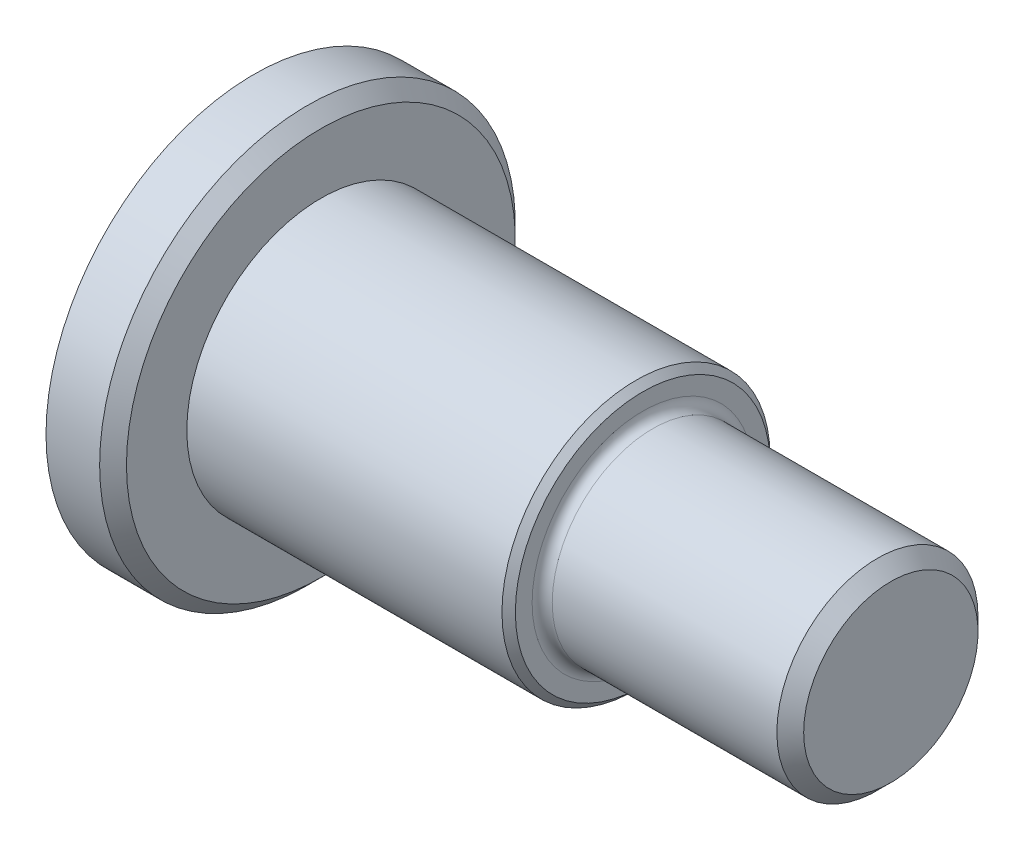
ISO-10303-21;
HEADER;
FILE_DESCRIPTION(('STEP AP214'),'2;1');
FILE_NAME('part.step','',(''),(''),'','','');
FILE_SCHEMA(('AUTOMOTIVE_DESIGN { 1 0 10303 214 1 1 1 1 }'));
ENDSEC;
DATA;
#1=APPLICATION_CONTEXT('core data for automotive mechanical design processes');
#2=APPLICATION_PROTOCOL_DEFINITION('international standard','automotive_design',2000,#1);
#3=PRODUCT_CONTEXT('',#1,'mechanical');
#4=PRODUCT('Part','Part','',(#3));
#5=PRODUCT_RELATED_PRODUCT_CATEGORY('part','',(#4));
#6=PRODUCT_DEFINITION_FORMATION('','',#4);
#7=PRODUCT_DEFINITION_CONTEXT('part definition',#1,'design');
#8=PRODUCT_DEFINITION('design','',#6,#7);
#9=PRODUCT_DEFINITION_SHAPE('','',#8);
#10=(LENGTH_UNIT() NAMED_UNIT(*) SI_UNIT(.MILLI.,.METRE.));
#11=(NAMED_UNIT(*) PLANE_ANGLE_UNIT() SI_UNIT($,.RADIAN.));
#12=(NAMED_UNIT(*) SI_UNIT($,.STERADIAN.) SOLID_ANGLE_UNIT());
#13=UNCERTAINTY_MEASURE_WITH_UNIT(LENGTH_MEASURE(1.E-05),#10,'distance_accuracy_value','');
#14=(GEOMETRIC_REPRESENTATION_CONTEXT(3) GLOBAL_UNCERTAINTY_ASSIGNED_CONTEXT((#13)) GLOBAL_UNIT_ASSIGNED_CONTEXT((#10,
#11,#12)) REPRESENTATION_CONTEXT('',''));
#15=CARTESIAN_POINT('',(0.,0.,0.));
#16=DIRECTION('',(0.,0.,1.));
#17=DIRECTION('',(1.,0.,0.));
#18=AXIS2_PLACEMENT_3D('',#15,#16,#17);
#19=CARTESIAN_POINT('',(1.50000000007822,0.,0.));
#20=DIRECTION('',(-1.,0.,0.));
#21=DIRECTION('',(0.,0.,1.));
#22=AXIS2_PLACEMENT_3D('',#19,#20,#21);
#23=CONICAL_SURFACE('',#22,1.2499999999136,1.02974425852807);
#24=CARTESIAN_POINT('',(2.25107577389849,0.,-5.6843418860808E-11));
#25=VERTEX_POINT('',#24);
#26=VERTEX_LOOP('',#25);
#27=FACE_BOUND('',#26,.T.);
#28=CARTESIAN_POINT('',(1.49999999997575,0.,0.));
#29=DIRECTION('',(-1.,0.,0.));
#30=DIRECTION('',(0.,0.,1.));
#31=AXIS2_PLACEMENT_3D('',#28,#29,#30);
#32=CIRCLE('',#31,1.25000000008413);
#33=CARTESIAN_POINT('',(1.49999999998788,-0.625000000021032,1.08253175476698));
#34=VERTEX_POINT('',#33);
#35=CARTESIAN_POINT('',(1.49999999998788,-1.25000000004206,0.));
#36=VERTEX_POINT('',#35);
#37=EDGE_CURVE('E157',#34,#36,#32,.F.);
#38=ORIENTED_EDGE('',*,*,#37,.F.);
#39=CARTESIAN_POINT('',(1.49999999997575,0.,0.));
#40=DIRECTION('',(-1.,0.,0.));
#41=DIRECTION('',(0.,0.,1.));
#42=AXIS2_PLACEMENT_3D('',#39,#40,#41);
#43=CIRCLE('',#42,1.25000000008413);
#44=CARTESIAN_POINT('',(1.49999999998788,0.625000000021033,1.08253175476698));
#45=VERTEX_POINT('',#44);
#46=EDGE_CURVE('E154',#45,#34,#43,.F.);
#47=ORIENTED_EDGE('',*,*,#46,.F.);
#48=CARTESIAN_POINT('',(1.49999999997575,0.,0.));
#49=DIRECTION('',(-1.,0.,0.));
#50=DIRECTION('',(0.,0.,1.));
#51=AXIS2_PLACEMENT_3D('',#48,#49,#50);
#52=CIRCLE('',#51,1.25000000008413);
#53=CARTESIAN_POINT('',(1.49999999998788,1.25000000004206,0.));
#54=VERTEX_POINT('',#53);
#55=EDGE_CURVE('E110',#54,#45,#52,.F.);
#56=ORIENTED_EDGE('',*,*,#55,.F.);
#57=CARTESIAN_POINT('',(1.49999999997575,0.,0.));
#58=DIRECTION('',(-1.,0.,0.));
#59=DIRECTION('',(0.,0.,1.));
#60=AXIS2_PLACEMENT_3D('',#57,#58,#59);
#61=CIRCLE('',#60,1.25000000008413);
#62=CARTESIAN_POINT('',(1.49999999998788,0.625000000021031,-1.08253175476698));
#63=VERTEX_POINT('',#62);
#64=EDGE_CURVE('E106',#63,#54,#61,.F.);
#65=ORIENTED_EDGE('',*,*,#64,.F.);
#66=CARTESIAN_POINT('',(1.49999999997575,0.,0.));
#67=DIRECTION('',(-1.,0.,0.));
#68=DIRECTION('',(0.,0.,1.));
#69=AXIS2_PLACEMENT_3D('',#66,#67,#68);
#70=CIRCLE('',#69,1.25000000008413);
#71=CARTESIAN_POINT('',(1.49999999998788,-0.625000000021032,-1.08253175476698));
#72=VERTEX_POINT('',#71);
#73=EDGE_CURVE('E93',#72,#63,#70,.F.);
#74=ORIENTED_EDGE('',*,*,#73,.F.);
#75=CARTESIAN_POINT('',(1.49999999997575,0.,0.));
#76=DIRECTION('',(-1.,0.,0.));
#77=DIRECTION('',(0.,0.,1.));
#78=AXIS2_PLACEMENT_3D('',#75,#76,#77);
#79=CIRCLE('',#78,1.25000000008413);
#80=EDGE_CURVE('E103',#36,#72,#79,.F.);
#81=ORIENTED_EDGE('',*,*,#80,.F.);
#82=EDGE_LOOP('',(#38,#47,#56,#65,#74,#81));
#83=FACE_BOUND('',#82,.T.);
#84=ADVANCED_FACE('F17',(#27,#83),#23,.F.);
#85=CARTESIAN_POINT('',(9.5,1.5,0.));
#86=DIRECTION('',(-1.,0.,0.));
#87=DIRECTION('',(0.,0.,1.));
#88=AXIS2_PLACEMENT_3D('',#85,#86,#87);
#89=PLANE('',#88);
#90=CARTESIAN_POINT('',(9.50000000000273,0.,0.));
#91=DIRECTION('',(-1.,0.,0.));
#92=DIRECTION('',(0.,0.,1.));
#93=AXIS2_PLACEMENT_3D('',#90,#91,#92);
#94=CIRCLE('',#93,1.30000000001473);
#95=CARTESIAN_POINT('',(9.50000000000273,0.,1.30000000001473));
#96=VERTEX_POINT('',#95);
#97=EDGE_CURVE('E114',#96,#96,#94,.T.);
#98=ORIENTED_EDGE('',*,*,#97,.F.);
#99=EDGE_LOOP('',(#98));
#100=FACE_BOUND('',#99,.T.);
#101=ADVANCED_FACE('F402',(#100),#89,.F.);
#102=CARTESIAN_POINT('',(1.5,1.25,0.721687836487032));
#103=DIRECTION('',(-1.,0.,0.));
#104=DIRECTION('',(0.,0.,1.));
#105=AXIS2_PLACEMENT_3D('',#102,#103,#104);
#106=PLANE('',#105);
#107=DIRECTION('',(0.,0.866025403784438,-0.5));
#108=VECTOR('',#107,1.);
#109=CARTESIAN_POINT('',(1.5,0.,-1.44337567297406));
#110=LINE('',#109,#108);
#111=CARTESIAN_POINT('',(1.5,0.,-1.44337567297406));
#112=VERTEX_POINT('',#111);
#113=EDGE_CURVE('E100',#112,#72,#110,.F.);
#114=ORIENTED_EDGE('',*,*,#113,.T.);
#115=ORIENTED_EDGE('',*,*,#73,.T.);
#116=DIRECTION('',(0.,0.866025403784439,0.499999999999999));
#117=VECTOR('',#116,1.);
#118=CARTESIAN_POINT('',(1.5,1.25,-0.721687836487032));
#119=LINE('',#118,#117);
#120=EDGE_CURVE('E97',#63,#112,#119,.F.);
#121=ORIENTED_EDGE('',*,*,#120,.T.);
#122=EDGE_LOOP('',(#114,#115,#121));
#123=FACE_BOUND('',#122,.T.);
#124=ADVANCED_FACE('F95',(#123),#106,.T.);
#125=CARTESIAN_POINT('',(1.5,1.25,0.721687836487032));
#126=DIRECTION('',(-1.,0.,0.));
#127=DIRECTION('',(0.,0.,1.));
#128=AXIS2_PLACEMENT_3D('',#125,#126,#127);
#129=PLANE('',#128);
#130=DIRECTION('',(0.,0.866025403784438,-0.5));
#131=VECTOR('',#130,1.);
#132=CARTESIAN_POINT('',(1.5,0.,-1.44337567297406));
#133=LINE('',#132,#131);
#134=CARTESIAN_POINT('',(1.5,-1.25,-0.721687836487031));
#135=VERTEX_POINT('',#134);
#136=EDGE_CURVE('E164',#72,#135,#133,.F.);
#137=ORIENTED_EDGE('',*,*,#136,.T.);
#138=DIRECTION('',(0.,0.,-1.));
#139=VECTOR('',#138,1.);
#140=CARTESIAN_POINT('',(1.5,-1.25,-0.721687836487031));
#141=LINE('',#140,#139);
#142=EDGE_CURVE('E167',#135,#36,#141,.F.);
#143=ORIENTED_EDGE('',*,*,#142,.T.);
#144=ORIENTED_EDGE('',*,*,#80,.T.);
#145=EDGE_LOOP('',(#137,#143,#144));
#146=FACE_BOUND('',#145,.T.);
#147=ADVANCED_FACE('F163',(#146),#129,.T.);
#148=CARTESIAN_POINT('',(1.5,1.25,0.721687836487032));
#149=DIRECTION('',(-1.,0.,0.));
#150=DIRECTION('',(0.,0.,1.));
#151=AXIS2_PLACEMENT_3D('',#148,#149,#150);
#152=PLANE('',#151);
#153=DIRECTION('',(0.,0.,-1.));
#154=VECTOR('',#153,1.);
#155=CARTESIAN_POINT('',(1.5,-1.25,-0.721687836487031));
#156=LINE('',#155,#154);
#157=CARTESIAN_POINT('',(1.5,-1.25,0.721687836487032));
#158=VERTEX_POINT('',#157);
#159=EDGE_CURVE('E201',#36,#158,#156,.F.);
#160=ORIENTED_EDGE('',*,*,#159,.T.);
#161=DIRECTION('',(0.,-0.866025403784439,-0.5));
#162=VECTOR('',#161,1.);
#163=CARTESIAN_POINT('',(1.5,-1.25,0.721687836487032));
#164=LINE('',#163,#162);
#165=EDGE_CURVE('E207',#158,#34,#164,.F.);
#166=ORIENTED_EDGE('',*,*,#165,.T.);
#167=ORIENTED_EDGE('',*,*,#37,.T.);
#168=EDGE_LOOP('',(#160,#166,#167));
#169=FACE_BOUND('',#168,.T.);
#170=ADVANCED_FACE('F396',(#169),#152,.T.);
#171=CARTESIAN_POINT('',(1.5,1.25,0.721687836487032));
#172=DIRECTION('',(-1.,0.,0.));
#173=DIRECTION('',(0.,0.,1.));
#174=AXIS2_PLACEMENT_3D('',#171,#172,#173);
#175=PLANE('',#174);
#176=DIRECTION('',(0.,-0.866025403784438,0.5));
#177=VECTOR('',#176,1.);
#178=CARTESIAN_POINT('',(1.5,0.,1.44337567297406));
#179=LINE('',#178,#177);
#180=CARTESIAN_POINT('',(1.5,0.,1.44337567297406));
#181=VERTEX_POINT('',#180);
#182=EDGE_CURVE('E226',#181,#45,#179,.F.);
#183=ORIENTED_EDGE('',*,*,#182,.T.);
#184=ORIENTED_EDGE('',*,*,#46,.T.);
#185=DIRECTION('',(0.,-0.866025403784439,-0.5));
#186=VECTOR('',#185,1.);
#187=CARTESIAN_POINT('',(1.5,-1.25,0.721687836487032));
#188=LINE('',#187,#186);
#189=EDGE_CURVE('E215',#34,#181,#188,.F.);
#190=ORIENTED_EDGE('',*,*,#189,.T.);
#191=EDGE_LOOP('',(#183,#184,#190));
#192=FACE_BOUND('',#191,.T.);
#193=ADVANCED_FACE('F368',(#192),#175,.T.);
#194=CARTESIAN_POINT('',(1.5,1.25,0.721687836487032));
#195=DIRECTION('',(-1.,0.,0.));
#196=DIRECTION('',(0.,0.,1.));
#197=AXIS2_PLACEMENT_3D('',#194,#195,#196);
#198=PLANE('',#197);
#199=DIRECTION('',(0.,-0.866025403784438,0.5));
#200=VECTOR('',#199,1.);
#201=CARTESIAN_POINT('',(1.5,0.,1.44337567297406));
#202=LINE('',#201,#200);
#203=CARTESIAN_POINT('',(1.5,1.25,0.721687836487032));
#204=VERTEX_POINT('',#203);
#205=EDGE_CURVE('E231',#45,#204,#202,.F.);
#206=ORIENTED_EDGE('',*,*,#205,.T.);
#207=DIRECTION('',(0.,0.,1.));
#208=VECTOR('',#207,1.);
#209=CARTESIAN_POINT('',(1.5,1.25,0.721687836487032));
#210=LINE('',#209,#208);
#211=EDGE_CURVE('E248',#204,#54,#210,.F.);
#212=ORIENTED_EDGE('',*,*,#211,.T.);
#213=ORIENTED_EDGE('',*,*,#55,.T.);
#214=EDGE_LOOP('',(#206,#212,#213));
#215=FACE_BOUND('',#214,.T.);
#216=ADVANCED_FACE('F366',(#215),#198,.T.);
#217=CARTESIAN_POINT('',(1.5,1.25,0.721687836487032));
#218=DIRECTION('',(-1.,0.,0.));
#219=DIRECTION('',(0.,0.,1.));
#220=AXIS2_PLACEMENT_3D('',#217,#218,#219);
#221=PLANE('',#220);
#222=DIRECTION('',(0.,0.,1.));
#223=VECTOR('',#222,1.);
#224=CARTESIAN_POINT('',(1.5,1.25,0.721687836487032));
#225=LINE('',#224,#223);
#226=CARTESIAN_POINT('',(1.5,1.25,-0.721687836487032));
#227=VERTEX_POINT('',#226);
#228=EDGE_CURVE('E119',#54,#227,#225,.F.);
#229=ORIENTED_EDGE('',*,*,#228,.T.);
#230=DIRECTION('',(0.,0.866025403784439,0.499999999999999));
#231=VECTOR('',#230,1.);
#232=CARTESIAN_POINT('',(1.5,1.25,-0.721687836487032));
#233=LINE('',#232,#231);
#234=EDGE_CURVE('E117',#227,#63,#233,.F.);
#235=ORIENTED_EDGE('',*,*,#234,.T.);
#236=ORIENTED_EDGE('',*,*,#64,.T.);
#237=EDGE_LOOP('',(#229,#235,#236));
#238=FACE_BOUND('',#237,.T.);
#239=ADVANCED_FACE('F118',(#238),#221,.T.);
#240=CARTESIAN_POINT('',(9.29999999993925,0.,0.));
#241=DIRECTION('',(-1.,0.,0.));
#242=DIRECTION('',(0.,0.,1.));
#243=AXIS2_PLACEMENT_3D('',#240,#241,#242);
#244=CONICAL_SURFACE('',#243,1.50000000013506,0.785398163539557);
#245=CARTESIAN_POINT('',(9.3,0.,0.));
#246=DIRECTION('',(-1.,0.,0.));
#247=DIRECTION('',(0.,0.,1.));
#248=AXIS2_PLACEMENT_3D('',#245,#246,#247);
#249=CIRCLE('',#248,1.5);
#250=CARTESIAN_POINT('',(9.3,0.,1.5));
#251=VERTEX_POINT('',#250);
#252=EDGE_CURVE('E137',#251,#251,#249,.T.);
#253=ORIENTED_EDGE('',*,*,#252,.F.);
#254=EDGE_LOOP('',(#253));
#255=FACE_BOUND('',#254,.T.);
#256=ORIENTED_EDGE('',*,*,#97,.T.);
#257=EDGE_LOOP('',(#256));
#258=FACE_BOUND('',#257,.T.);
#259=ADVANCED_FACE('F386',(#255,#258),#244,.T.);
#260=CARTESIAN_POINT('',(1.5,1.25,-0.721687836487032));
#261=DIRECTION('',(0.,0.499999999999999,-0.866025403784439));
#262=DIRECTION('',(0.,0.866025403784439,0.499999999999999));
#263=AXIS2_PLACEMENT_3D('',#260,#261,#262);
#264=PLANE('',#263);
#265=DIRECTION('',(1.,0.,0.));
#266=VECTOR('',#265,1.);
#267=CARTESIAN_POINT('',(1.5,0.,-1.44337567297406));
#268=LINE('',#267,#266);
#269=CARTESIAN_POINT('',(0.,0.,-1.44337567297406));
#270=VERTEX_POINT('',#269);
#271=EDGE_CURVE('E126',#270,#112,#268,.T.);
#272=ORIENTED_EDGE('',*,*,#271,.T.);
#273=ORIENTED_EDGE('',*,*,#120,.F.);
#274=ORIENTED_EDGE('',*,*,#234,.F.);
#275=DIRECTION('',(1.,0.,0.));
#276=VECTOR('',#275,1.);
#277=CARTESIAN_POINT('',(1.5,1.25,-0.721687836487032));
#278=LINE('',#277,#276);
#279=CARTESIAN_POINT('',(0.,1.25,-0.721687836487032));
#280=VERTEX_POINT('',#279);
#281=EDGE_CURVE('E251',#227,#280,#278,.F.);
#282=ORIENTED_EDGE('',*,*,#281,.T.);
#283=DIRECTION('',(0.,-0.866025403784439,-0.499999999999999));
#284=VECTOR('',#283,1.);
#285=CARTESIAN_POINT('',(0.,1.25,-0.721687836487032));
#286=LINE('',#285,#284);
#287=EDGE_CURVE('E134',#280,#270,#286,.T.);
#288=ORIENTED_EDGE('',*,*,#287,.T.);
#289=EDGE_LOOP('',(#272,#273,#274,#282,#288));
#290=FACE_BOUND('',#289,.T.);
#291=ADVANCED_FACE('F124',(#290),#264,.F.);
#292=CARTESIAN_POINT('',(1.5,0.,-1.44337567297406));
#293=DIRECTION('',(0.,-0.5,-0.866025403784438));
#294=DIRECTION('',(0.,0.866025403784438,-0.5));
#295=AXIS2_PLACEMENT_3D('',#292,#293,#294);
#296=PLANE('',#295);
#297=DIRECTION('',(1.,0.,0.));
#298=VECTOR('',#297,1.);
#299=CARTESIAN_POINT('',(1.5,-1.25,-0.721687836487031));
#300=LINE('',#299,#298);
#301=CARTESIAN_POINT('',(0.,-1.25,-0.721687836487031));
#302=VERTEX_POINT('',#301);
#303=EDGE_CURVE('E171',#302,#135,#300,.T.);
#304=ORIENTED_EDGE('',*,*,#303,.T.);
#305=ORIENTED_EDGE('',*,*,#136,.F.);
#306=ORIENTED_EDGE('',*,*,#113,.F.);
#307=ORIENTED_EDGE('',*,*,#271,.F.);
#308=DIRECTION('',(0.,-0.866025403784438,0.5));
#309=VECTOR('',#308,1.);
#310=CARTESIAN_POINT('',(0.,0.,-1.44337567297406));
#311=LINE('',#310,#309);
#312=EDGE_CURVE('E136',#270,#302,#311,.T.);
#313=ORIENTED_EDGE('',*,*,#312,.T.);
#314=EDGE_LOOP('',(#304,#305,#306,#307,#313));
#315=FACE_BOUND('',#314,.T.);
#316=ADVANCED_FACE('F169',(#315),#296,.F.);
#317=CARTESIAN_POINT('',(1.5,-1.25,-0.721687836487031));
#318=DIRECTION('',(0.,-1.,0.));
#319=DIRECTION('',(0.,0.,-1.));
#320=AXIS2_PLACEMENT_3D('',#317,#318,#319);
#321=PLANE('',#320);
#322=DIRECTION('',(1.,0.,0.));
#323=VECTOR('',#322,1.);
#324=CARTESIAN_POINT('',(1.5,-1.25,0.721687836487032));
#325=LINE('',#324,#323);
#326=CARTESIAN_POINT('',(0.,-1.25,0.721687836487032));
#327=VERTEX_POINT('',#326);
#328=EDGE_CURVE('E203',#327,#158,#325,.T.);
#329=ORIENTED_EDGE('',*,*,#328,.T.);
#330=ORIENTED_EDGE('',*,*,#159,.F.);
#331=ORIENTED_EDGE('',*,*,#142,.F.);
#332=ORIENTED_EDGE('',*,*,#303,.F.);
#333=DIRECTION('',(0.,0.,-1.));
#334=VECTOR('',#333,1.);
#335=CARTESIAN_POINT('',(0.,-1.25,0.));
#336=LINE('',#335,#334);
#337=EDGE_CURVE('E181',#302,#327,#336,.F.);
#338=ORIENTED_EDGE('',*,*,#337,.T.);
#339=EDGE_LOOP('',(#329,#330,#331,#332,#338));
#340=FACE_BOUND('',#339,.T.);
#341=ADVANCED_FACE('F373',(#340),#321,.F.);
#342=CARTESIAN_POINT('',(1.5,-1.25,0.721687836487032));
#343=DIRECTION('',(0.,-0.5,0.866025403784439));
#344=DIRECTION('',(0.,-0.866025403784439,-0.5));
#345=AXIS2_PLACEMENT_3D('',#342,#343,#344);
#346=PLANE('',#345);
#347=DIRECTION('',(1.,0.,0.));
#348=VECTOR('',#347,1.);
#349=CARTESIAN_POINT('',(1.5,0.,1.44337567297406));
#350=LINE('',#349,#348);
#351=CARTESIAN_POINT('',(0.,0.,1.44337567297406));
#352=VERTEX_POINT('',#351);
#353=EDGE_CURVE('E221',#352,#181,#350,.T.);
#354=ORIENTED_EDGE('',*,*,#353,.T.);
#355=ORIENTED_EDGE('',*,*,#189,.F.);
#356=ORIENTED_EDGE('',*,*,#165,.F.);
#357=ORIENTED_EDGE('',*,*,#328,.F.);
#358=DIRECTION('',(0.,0.866025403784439,0.5));
#359=VECTOR('',#358,1.);
#360=CARTESIAN_POINT('',(0.,-1.25,0.721687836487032));
#361=LINE('',#360,#359);
#362=EDGE_CURVE('E186',#327,#352,#361,.T.);
#363=ORIENTED_EDGE('',*,*,#362,.T.);
#364=EDGE_LOOP('',(#354,#355,#356,#357,#363));
#365=FACE_BOUND('',#364,.T.);
#366=ADVANCED_FACE('F372',(#365),#346,.F.);
#367=CARTESIAN_POINT('',(1.5,0.,1.44337567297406));
#368=DIRECTION('',(0.,0.5,0.866025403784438));
#369=DIRECTION('',(0.,-0.866025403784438,0.5));
#370=AXIS2_PLACEMENT_3D('',#367,#368,#369);
#371=PLANE('',#370);
#372=DIRECTION('',(1.,0.,0.));
#373=VECTOR('',#372,1.);
#374=CARTESIAN_POINT('',(1.5,1.25,0.721687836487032));
#375=LINE('',#374,#373);
#376=CARTESIAN_POINT('',(0.,1.25,0.721687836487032));
#377=VERTEX_POINT('',#376);
#378=EDGE_CURVE('E243',#377,#204,#375,.T.);
#379=ORIENTED_EDGE('',*,*,#378,.T.);
#380=ORIENTED_EDGE('',*,*,#205,.F.);
#381=ORIENTED_EDGE('',*,*,#182,.F.);
#382=ORIENTED_EDGE('',*,*,#353,.F.);
#383=DIRECTION('',(0.,0.866025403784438,-0.5));
#384=VECTOR('',#383,1.);
#385=CARTESIAN_POINT('',(0.,0.,1.44337567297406));
#386=LINE('',#385,#384);
#387=EDGE_CURVE('E192',#352,#377,#386,.T.);
#388=ORIENTED_EDGE('',*,*,#387,.T.);
#389=EDGE_LOOP('',(#379,#380,#381,#382,#388));
#390=FACE_BOUND('',#389,.T.);
#391=ADVANCED_FACE('F359',(#390),#371,.F.);
#392=CARTESIAN_POINT('',(1.5,1.25,0.721687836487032));
#393=DIRECTION('',(0.,1.,0.));
#394=DIRECTION('',(0.,0.,1.));
#395=AXIS2_PLACEMENT_3D('',#392,#393,#394);
#396=PLANE('',#395);
#397=ORIENTED_EDGE('',*,*,#281,.F.);
#398=ORIENTED_EDGE('',*,*,#228,.F.);
#399=ORIENTED_EDGE('',*,*,#211,.F.);
#400=ORIENTED_EDGE('',*,*,#378,.F.);
#401=DIRECTION('',(0.,0.,-1.));
#402=VECTOR('',#401,1.);
#403=CARTESIAN_POINT('',(0.,1.25,0.));
#404=LINE('',#403,#402);
#405=EDGE_CURVE('E234',#377,#280,#404,.T.);
#406=ORIENTED_EDGE('',*,*,#405,.T.);
#407=EDGE_LOOP('',(#397,#398,#399,#400,#406));
#408=FACE_BOUND('',#407,.T.);
#409=ADVANCED_FACE('F364',(#408),#396,.F.);
#410=CARTESIAN_POINT('',(0.,0.,0.));
#411=DIRECTION('',(-1.,0.,0.));
#412=DIRECTION('',(0.,0.,1.));
#413=AXIS2_PLACEMENT_3D('',#410,#411,#412);
#414=CYLINDRICAL_SURFACE('',#413,1.5);
#415=CARTESIAN_POINT('',(5.95,0.,0.));
#416=DIRECTION('',(-1.,0.,0.));
#417=DIRECTION('',(0.,0.,1.));
#418=AXIS2_PLACEMENT_3D('',#415,#416,#417);
#419=CIRCLE('',#418,1.5);
#420=CARTESIAN_POINT('',(5.95,0.,1.5));
#421=VERTEX_POINT('',#420);
#422=EDGE_CURVE('E150',#421,#421,#419,.F.);
#423=ORIENTED_EDGE('',*,*,#422,.T.);
#424=EDGE_LOOP('',(#423));
#425=FACE_BOUND('',#424,.T.);
#426=ORIENTED_EDGE('',*,*,#252,.T.);
#427=EDGE_LOOP('',(#426));
#428=FACE_BOUND('',#427,.T.);
#429=ADVANCED_FACE('F351',(#425,#428),#414,.T.);
#430=CARTESIAN_POINT('',(0.,0.,0.));
#431=DIRECTION('',(1.,0.,0.));
#432=DIRECTION('',(0.,0.,-1.));
#433=AXIS2_PLACEMENT_3D('',#430,#431,#432);
#434=PLANE('',#433);
#435=CARTESIAN_POINT('',(0.,0.,0.));
#436=DIRECTION('',(-1.,0.,0.));
#437=DIRECTION('',(0.,0.,1.));
#438=AXIS2_PLACEMENT_3D('',#435,#436,#437);
#439=CIRCLE('',#438,3.1);
#440=CARTESIAN_POINT('',(0.,0.,3.1));
#441=VERTEX_POINT('',#440);
#442=EDGE_CURVE('E147',#441,#441,#439,.F.);
#443=ORIENTED_EDGE('',*,*,#442,.F.);
#444=EDGE_LOOP('',(#443));
#445=FACE_BOUND('',#444,.T.);
#446=ORIENTED_EDGE('',*,*,#387,.F.);
#447=ORIENTED_EDGE('',*,*,#362,.F.);
#448=ORIENTED_EDGE('',*,*,#337,.F.);
#449=ORIENTED_EDGE('',*,*,#312,.F.);
#450=ORIENTED_EDGE('',*,*,#287,.F.);
#451=ORIENTED_EDGE('',*,*,#405,.F.);
#452=EDGE_LOOP('',(#446,#447,#448,#449,#450,#451));
#453=FACE_BOUND('',#452,.T.);
#454=ADVANCED_FACE('F280',(#445,#453),#434,.F.);
#455=CARTESIAN_POINT('',(5.95,0.,0.));
#456=DIRECTION('',(-1.,0.,0.));
#457=DIRECTION('',(0.,0.,1.));
#458=AXIS2_PLACEMENT_3D('',#455,#456,#457);
#459=TOROIDAL_SURFACE('',#458,1.65,0.15);
#460=CARTESIAN_POINT('',(5.8,0.,0.));
#461=DIRECTION('',(1.,0.,0.));
#462=DIRECTION('',(0.,0.,-1.));
#463=AXIS2_PLACEMENT_3D('',#460,#461,#462);
#464=CIRCLE('',#463,1.65);
#465=CARTESIAN_POINT('',(5.8,0.,-1.65));
#466=VERTEX_POINT('',#465);
#467=CARTESIAN_POINT('',(5.8,0.,1.65));
#468=VERTEX_POINT('',#467);
#469=EDGE_CURVE('E288',#466,#468,#464,.T.);
#470=ORIENTED_EDGE('',*,*,#469,.T.);
#471=CARTESIAN_POINT('',(5.8,0.,0.));
#472=DIRECTION('',(1.,0.,0.));
#473=DIRECTION('',(0.,0.,1.));
#474=AXIS2_PLACEMENT_3D('',#471,#472,#473);
#475=CIRCLE('',#474,1.65);
#476=EDGE_CURVE('E36',#468,#466,#475,.T.);
#477=ORIENTED_EDGE('',*,*,#476,.T.);
#478=EDGE_LOOP('',(#470,#477));
#479=FACE_BOUND('',#478,.T.);
#480=ORIENTED_EDGE('',*,*,#422,.F.);
#481=EDGE_LOOP('',(#480));
#482=FACE_BOUND('',#481,.T.);
#483=ADVANCED_FACE('F269',(#479,#482),#459,.F.);
#484=CARTESIAN_POINT('',(0.,0.,0.));
#485=DIRECTION('',(-1.,0.,0.));
#486=DIRECTION('',(0.,0.,1.));
#487=AXIS2_PLACEMENT_3D('',#484,#485,#486);
#488=CYLINDRICAL_SURFACE('',#487,3.1);
#489=CARTESIAN_POINT('',(0.800000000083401,0.,0.));
#490=DIRECTION('',(-1.,0.,0.));
#491=DIRECTION('',(0.,0.,1.));
#492=AXIS2_PLACEMENT_3D('',#489,#490,#491);
#493=CIRCLE('',#492,3.10000000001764);
#494=CARTESIAN_POINT('',(0.800000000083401,0.,3.10000000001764));
#495=VERTEX_POINT('',#494);
#496=EDGE_CURVE('E146',#495,#495,#493,.F.);
#497=ORIENTED_EDGE('',*,*,#496,.F.);
#498=EDGE_LOOP('',(#497));
#499=FACE_BOUND('',#498,.T.);
#500=ORIENTED_EDGE('',*,*,#442,.T.);
#501=EDGE_LOOP('',(#500));
#502=FACE_BOUND('',#501,.T.);
#503=ADVANCED_FACE('F279',(#499,#502),#488,.T.);
#504=CARTESIAN_POINT('',(5.8,2.,0.));
#505=DIRECTION('',(-1.,0.,0.));
#506=DIRECTION('',(0.,0.,1.));
#507=AXIS2_PLACEMENT_3D('',#504,#505,#506);
#508=PLANE('',#507);
#509=CARTESIAN_POINT('',(5.80000000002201,0.,0.));
#510=DIRECTION('',(-1.,0.,0.));
#511=DIRECTION('',(0.,0.,1.));
#512=AXIS2_PLACEMENT_3D('',#509,#510,#511);
#513=CIRCLE('',#512,1.90000000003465);
#514=CARTESIAN_POINT('',(5.80000000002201,0.,1.90000000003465));
#515=VERTEX_POINT('',#514);
#516=EDGE_CURVE('E143',#515,#515,#513,.T.);
#517=ORIENTED_EDGE('',*,*,#516,.F.);
#518=EDGE_LOOP('',(#517));
#519=FACE_BOUND('',#518,.T.);
#520=ORIENTED_EDGE('',*,*,#476,.F.);
#521=ORIENTED_EDGE('',*,*,#469,.F.);
#522=EDGE_LOOP('',(#520,#521));
#523=FACE_BOUND('',#522,.T.);
#524=ADVANCED_FACE('F293',(#519,#523),#508,.F.);
#525=CARTESIAN_POINT('',(0.800000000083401,0.,0.));
#526=DIRECTION('',(-1.,0.,0.));
#527=DIRECTION('',(0.,0.,1.));
#528=AXIS2_PLACEMENT_3D('',#525,#526,#527);
#529=CONICAL_SURFACE('',#528,3.10000000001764,0.785398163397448);
#530=CARTESIAN_POINT('',(1.0000000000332,0.,0.));
#531=DIRECTION('',(-1.,0.,0.));
#532=DIRECTION('',(0.,0.,1.));
#533=AXIS2_PLACEMENT_3D('',#530,#531,#532);
#534=CIRCLE('',#533,2.90000000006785);
#535=CARTESIAN_POINT('',(1.0000000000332,0.,2.90000000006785));
#536=VERTEX_POINT('',#535);
#537=EDGE_CURVE('E140',#536,#536,#534,.T.);
#538=ORIENTED_EDGE('',*,*,#537,.T.);
#539=EDGE_LOOP('',(#538));
#540=FACE_BOUND('',#539,.T.);
#541=ORIENTED_EDGE('',*,*,#496,.T.);
#542=EDGE_LOOP('',(#541));
#543=FACE_BOUND('',#542,.T.);
#544=ADVANCED_FACE('F302',(#540,#543),#529,.T.);
#545=CARTESIAN_POINT('',(5.69999999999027,0.,0.));
#546=DIRECTION('',(-1.,0.,0.));
#547=DIRECTION('',(0.,0.,1.));
#548=AXIS2_PLACEMENT_3D('',#545,#546,#547);
#549=CONICAL_SURFACE('',#548,2.00000000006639,0.785398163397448);
#550=CARTESIAN_POINT('',(5.7,0.,0.));
#551=DIRECTION('',(-1.,0.,0.));
#552=DIRECTION('',(0.,0.,1.));
#553=AXIS2_PLACEMENT_3D('',#550,#551,#552);
#554=CIRCLE('',#553,2.);
#555=CARTESIAN_POINT('',(5.7,0.,2.));
#556=VERTEX_POINT('',#555);
#557=EDGE_CURVE('E28',#556,#556,#554,.T.);
#558=ORIENTED_EDGE('',*,*,#557,.F.);
#559=EDGE_LOOP('',(#558));
#560=FACE_BOUND('',#559,.T.);
#561=ORIENTED_EDGE('',*,*,#516,.T.);
#562=EDGE_LOOP('',(#561));
#563=FACE_BOUND('',#562,.T.);
#564=ADVANCED_FACE('F321',(#560,#563),#549,.T.);
#565=CARTESIAN_POINT('',(1.,3.1,0.));
#566=DIRECTION('',(-1.,0.,0.));
#567=DIRECTION('',(0.,0.,1.));
#568=AXIS2_PLACEMENT_3D('',#565,#566,#567);
#569=PLANE('',#568);
#570=CARTESIAN_POINT('',(1.,0.,0.));
#571=DIRECTION('',(-1.,0.,0.));
#572=DIRECTION('',(0.,0.,1.));
#573=AXIS2_PLACEMENT_3D('',#570,#571,#572);
#574=CIRCLE('',#573,2.);
#575=CARTESIAN_POINT('',(1.,0.,2.));
#576=VERTEX_POINT('',#575);
#577=EDGE_CURVE('E11',#576,#576,#574,.F.);
#578=ORIENTED_EDGE('',*,*,#577,.F.);
#579=EDGE_LOOP('',(#578));
#580=FACE_BOUND('',#579,.T.);
#581=ORIENTED_EDGE('',*,*,#537,.F.);
#582=EDGE_LOOP('',(#581));
#583=FACE_BOUND('',#582,.T.);
#584=ADVANCED_FACE('F324',(#580,#583),#569,.F.);
#585=CARTESIAN_POINT('',(0.,0.,0.));
#586=DIRECTION('',(-1.,0.,0.));
#587=DIRECTION('',(0.,0.,1.));
#588=AXIS2_PLACEMENT_3D('',#585,#586,#587);
#589=CYLINDRICAL_SURFACE('',#588,2.);
#590=ORIENTED_EDGE('',*,*,#577,.T.);
#591=EDGE_LOOP('',(#590));
#592=FACE_BOUND('',#591,.T.);
#593=ORIENTED_EDGE('',*,*,#557,.T.);
#594=EDGE_LOOP('',(#593));
#595=FACE_BOUND('',#594,.T.);
#596=ADVANCED_FACE('F319',(#592,#595),#589,.T.);
#597=CLOSED_SHELL('',(#84,#101,#124,#147,#170,#193,#216,#239,#259,#291,#316,#341,#366,#391,#409,
#429,#454,#483,#503,#524,#544,#564,#584,#596));
#598=MANIFOLD_SOLID_BREP('B1',#597);
#599=ADVANCED_BREP_SHAPE_REPRESENTATION('',(#18,#598),#14);
#600=SHAPE_DEFINITION_REPRESENTATION(#9,#599);
ENDSEC;
END-ISO-10303-21;
